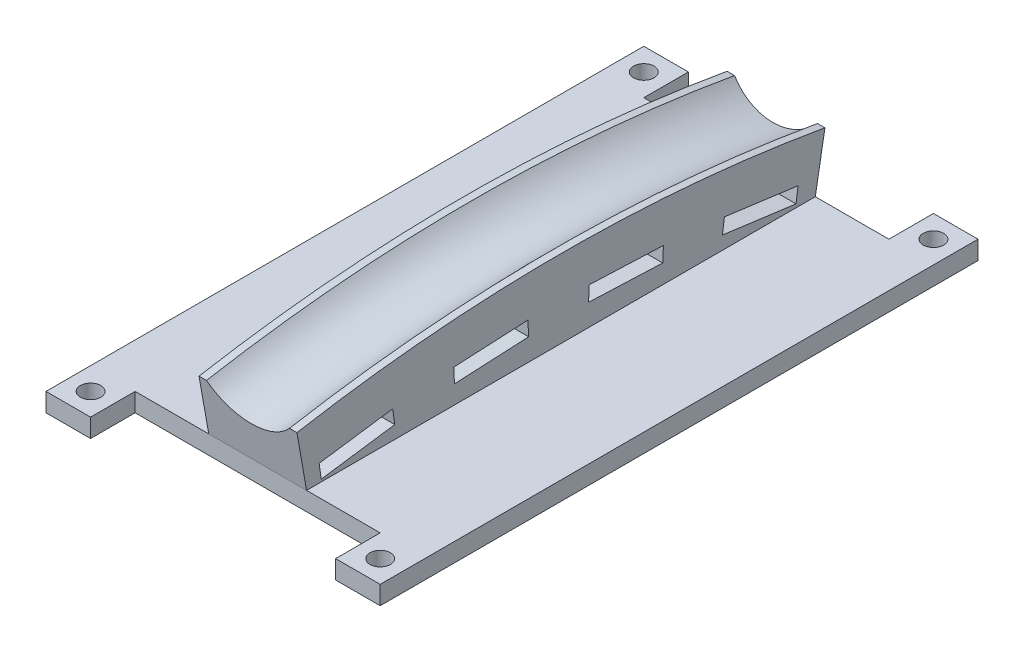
from build123d import *

# Parameters (mm, degrees)
SKETCH2_R           = 2.75
BOSS_EXTRUDE1_DEPTH = 5
BOSS_EXTRUDE2_DEPTH = 0.001
REVOLVE1_ANGLE      = 20
BOSS_EXTRUDE3_DEPTH = 26.360679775
CUT_EXTRUDE1_DEPTH  = 174.151917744
CIRPATTERN1_COUNT   = 4
CIRPATTERN1_ANGLE   = 15.75


with BuildPart() as part:
    # Sketch2 → Boss-Extrude1 (new body)
    with BuildSketch(Plane(origin=(0, 0, 0), x_dir=(1, 0, 0), z_dir=(0, 1, 0))):
        Polygon((0, 0), (12, 0), (12, 12), (78, 12), (78, 0), (90, 0), (90, 161), (78, 161), (78, 149), (12, 149), (12, 161), (0, 161), align=None)
        with Locations(Location((6, 155, 0), (0, 0, 270))):
            Circle(SKETCH2_R, mode=Mode.SUBTRACT)
        with Locations(Location((84, 155, 0), (0, 0, 270))):
            Circle(SKETCH2_R, mode=Mode.SUBTRACT)
        with Locations(Location((84, 6, 0), (0, 0, 270))):
            Circle(SKETCH2_R, mode=Mode.SUBTRACT)
        with Locations(Location((6, 6, 0), (0, 0, 270))):
            Circle(SKETCH2_R, mode=Mode.SUBTRACT)
    extrude(amount=BOSS_EXTRUDE1_DEPTH)



with BuildPart() as body_2:
    # Sketch15 → Boss-Extrude2 (new body)
    with BuildSketch(Plane(origin=(0, 2.202889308, -12.493206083), x_dir=(1, 0, 0), z_dir=(0, -0.17364817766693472, 0.9848077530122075))):
        with BuildLine():
            Line((31.819660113, 2.840260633), (58.180339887, 2.840260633))
            Line((58.180339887, 2.840260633), (58.180339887, 17.840260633))
            Line((58.180339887, 17.840260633), (56.180339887, 17.840260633))
            ThreePointArc((56.180339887, 17.840260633), (45, 12.840260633), (33.819660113, 17.840260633))
            Line((33.819660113, 17.840260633), (31.819660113, 17.840260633))
            Line((31.819660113, 17.840260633), (31.819660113, 2.840260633))
        make_face()
    extrude(amount=-BOSS_EXTRUDE2_DEPTH)

    # Sketch15_2 → Revolve1 (revolve)
    with BuildSketch(Plane(origin=(0, 2.202889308, -12.493206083), x_dir=(1, 0, 0), z_dir=(0, -0.17364817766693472, 0.9848077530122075))):
        with BuildLine():
            Line((31.819660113, 2.840260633), (58.180339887, 2.840260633))
            Line((58.180339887, 2.840260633), (58.180339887, 17.840260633))
            Line((58.180339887, 17.840260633), (56.180339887, 17.840260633))
            ThreePointArc((56.180339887, 17.840260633), (45, 12.840260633), (33.819660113, 17.840260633))
            Line((33.819660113, 17.840260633), (31.819660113, 17.840260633))
            Line((31.819660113, 17.840260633), (31.819660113, 2.840260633))
        make_face()
    revolve(axis=Axis((90, -383.482804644, -80.5), (-1, 0, 0)), revolution_arc=REVOLVE1_ANGLE)


with BuildPart() as part_1:
    add(part.part)

    add(body_2.part)  # Boss-Extrude3 merges body 2
    # Sketch23 → Boss-Extrude3 (add)
    with BuildSketch(Plane(origin=(58.180339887, 0, 0), x_dir=(0, 0, -1), z_dir=(1, 0, 0))):
        Polygon((12, 5), (149, 5), (110.925397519, 19.579495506), (35.890548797, 14.3178134), align=None)
    extrude(amount=-BOSS_EXTRUDE3_DEPTH)

    # Sketch24 → Cut-Extrude1 (cut, through all)
    with BuildSketch(Plane(origin=(58.180339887, 0, 0), x_dir=(0, 0, -1), z_dir=(1, 0, 0))):
        Polygon((15.946828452, 5.651505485), (15.381143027, 9.61130346), (35.180132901, 12.439730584), (35.745818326, 8.47993261), align=None)
    cut_extrude1 = extrude(amount=-CUT_EXTRUDE1_DEPTH, mode=Mode.SUBTRACT)

    # CirPattern1: Cut-Extrude1 ×4 about axis
    cirpattern1_axis = Axis((0, -383.482804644, -80.5), (-1, 0, 0))
    for i in range(1, CIRPATTERN1_COUNT):
        add(cut_extrude1.rotate(cirpattern1_axis, i * CIRPATTERN1_ANGLE / (CIRPATTERN1_COUNT - 1)), mode=Mode.SUBTRACT)


solid = part_1.part
